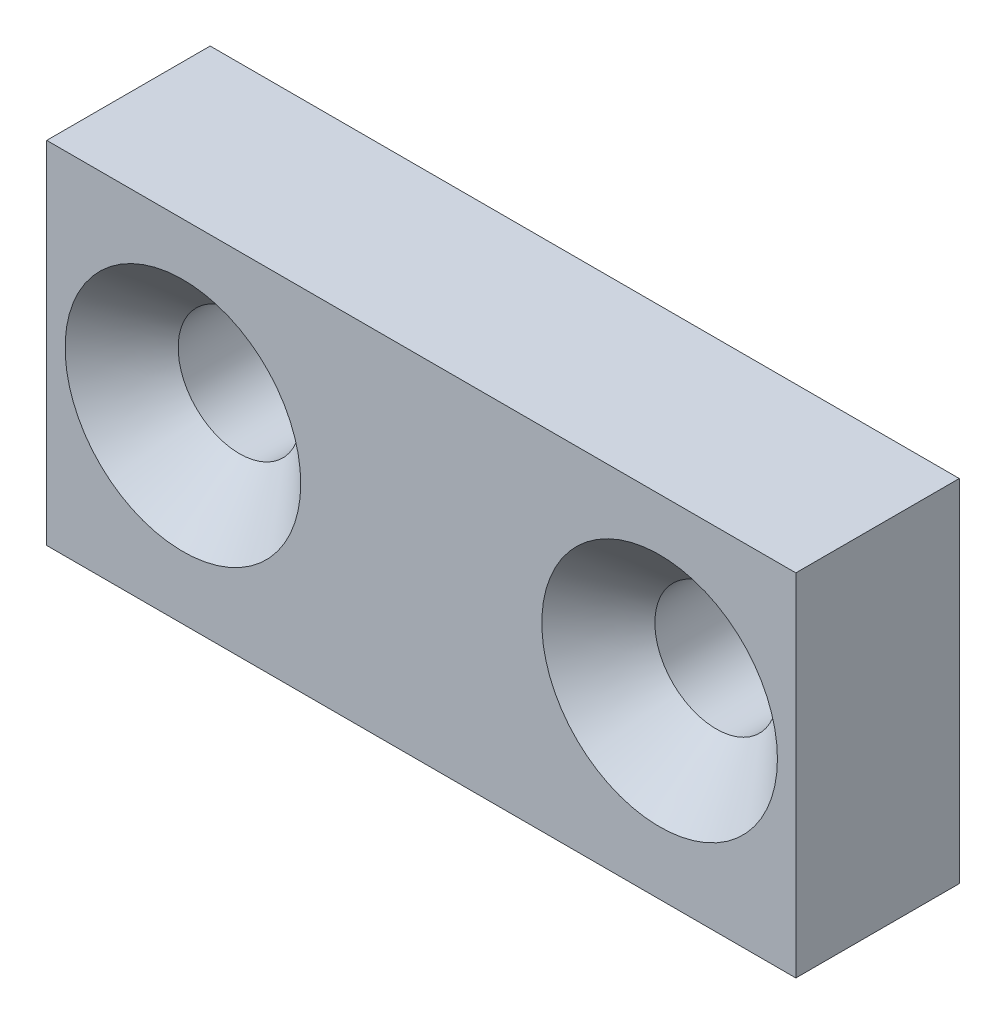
from build123d import *

# Parameters (mm, degrees)
ESQUISSE1_W                                    = 55
ESQUISSE1_H                                    = 25.76
EXTRUSION1_DEPTH                               = 12
FRAISAGE_POUR_VIS_T_TE_FRAIS_E_M81_D           = 9
FRAISAGE_POUR_VIS_T_TE_FRAIS_E_M81_CSINK_D     = 17.3
FRAISAGE_POUR_VIS_T_TE_FRAIS_E_M81_CSINK_ANGLE = 90


with BuildPart() as part:
    # Esquisse1 → Extrusion1 (new body)
    with BuildSketch(Plane.XY):
        with Locations((-570.5, 12.88)):
            Rectangle(ESQUISSE1_W, ESQUISSE1_H)
    extrude(amount=EXTRUSION1_DEPTH)

    # Fraisage pour vis _ t_te frais_e M81 (through all)
    with Locations(Plane.XY.offset(12)):
        with Locations((-553, 13.26), (-588, 13.26)):
            CounterSinkHole(FRAISAGE_POUR_VIS_T_TE_FRAIS_E_M81_D / 2, FRAISAGE_POUR_VIS_T_TE_FRAIS_E_M81_CSINK_D / 2, counter_sink_angle=FRAISAGE_POUR_VIS_T_TE_FRAIS_E_M81_CSINK_ANGLE)


solid = part.part
